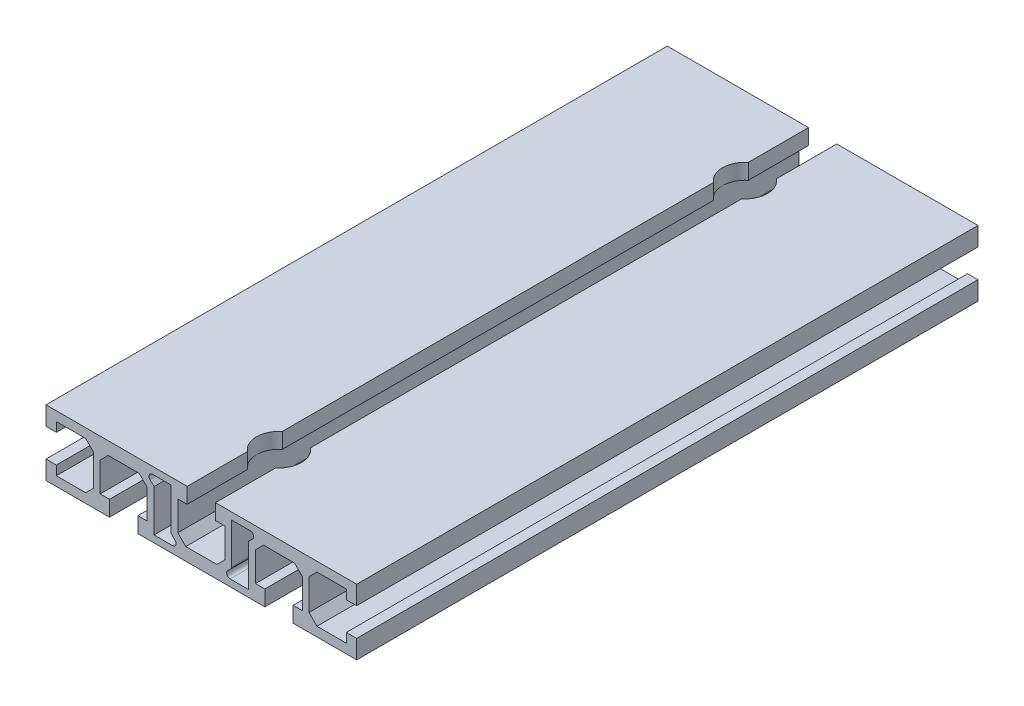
from build123d import *

# Parameters (mm, degrees)
EXTRUDE1_DEPTH      = 90
EXTRUDE1_DEPTH_BACK = 90
SKETCH2_R           = 6.5
EXTRUDE2_DEPTH      = 103.401171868


with BuildPart() as part:
    # Sketch1 → Extrude1 (new, two sides: drawn at the far end of the back side and taken through both)
    with BuildSketch(Plane.XY.offset(-EXTRUDE1_DEPTH_BACK)):
        Polygon((-18.4, -9.5), (18.4, -9.5), (18.4, -5), (15.7, -5), (15.7, 3.5), (18, 5.8), (27, 5.8), (29.3, 3.5), (29.3, -5), (26.6, -5), (26.6, -9.5), (45, -9.5), (45, -4.1), (42, -4.1), (42, -6.8), (33.5, -6.8), (31.2, -4.5), (31.2, 4.5), (33.5, 6.8), (42, 6.8), (42, 4.1), (45, 4.1), (45, 9.5), (4.1, 9.5), (4.1, 5), (6.8, 5), (6.8, -3.5), (4.5, -5.8), (-4.5, -5.8), (-6.8, -3.5), (-6.8, 5), (-4.1, 5), (-4.1, 9.5), (-45, 9.5), (-45, 4.1), (-42, 4.1), (-42, 6.8), (-33.5, 6.8), (-31.2, 4.5), (-31.2, -4.5), (-33.5, -6.8), (-42, -6.8), (-42, -4.1), (-45, -4.1), (-45, -9.5), (-26.6, -9.5), (-26.6, -5), (-29.3, -5), (-29.3, 3.5), (-27, 5.8), (-18, 5.8), (-15.7, 3.5), (-15.7, -5), (-18.4, -5), align=None)
        with BuildLine():
            Line((-8.342672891, -7.500000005), (-13.700000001, -7.500000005))
            Line((-13.700000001, -7.500000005), (-13.700000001, 4.628406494))
            Line((-13.700000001, 4.628406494), (-14.864479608, 5.792906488))
            ThreePointArc((-14.864479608, 5.792906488), (-15.081242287, 6.882687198), (-14.157369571, 7.499993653))
            Line((-14.157369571, 7.499993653), (-8.800006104, 7.499993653))
            Line((-8.800006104, 7.499993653), (-8.800006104, -4.62845362))
            Line((-8.800006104, -4.62845362), (-7.635546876, -5.792892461))
            ThreePointArc((-7.635546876, -5.792892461), (-7.418791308, -6.882686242), (-8.342672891, -7.500000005))
        make_face(mode=Mode.SUBTRACT)
        with BuildLine():
            Line((7.635546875, -5.79289246), (8.507128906, -4.921325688))
            ThreePointArc((8.507128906, -4.921325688), (8.723890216, -4.596890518), (8.800006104, -4.214202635))
            Line((8.800006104, -4.214202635), (8.800006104, 7.499999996))
            Line((8.800006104, 7.499999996), (14.15736465, 7.499999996))
            ThreePointArc((14.15736465, 7.499999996), (15.081238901, 6.882677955), (14.864449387, 5.792892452))
            Line((14.864449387, 5.792892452), (13.700009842, 4.62843252))
            Line((13.700009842, 4.62843252), (13.700009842, -7.499990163))
            Line((13.700009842, -7.499990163), (8.342669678, -7.499990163))
            ThreePointArc((8.342669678, -7.499990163), (7.418801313, -6.882676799), (7.635546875, -5.79289246))
        make_face(mode=Mode.SUBTRACT)
    extrude(amount=EXTRUDE1_DEPTH + EXTRUDE1_DEPTH_BACK)

    # Sketch2 → Extrude2 (cut, through all)
    with BuildSketch(Plane.XZ.offset(9.5)):
        with Locations((0, 67.5)):
            Circle(SKETCH2_R)
        with Locations((0, -67.5)):
            Circle(SKETCH2_R)
    extrude(amount=-EXTRUDE2_DEPTH, mode=Mode.SUBTRACT)


solid = part.part
